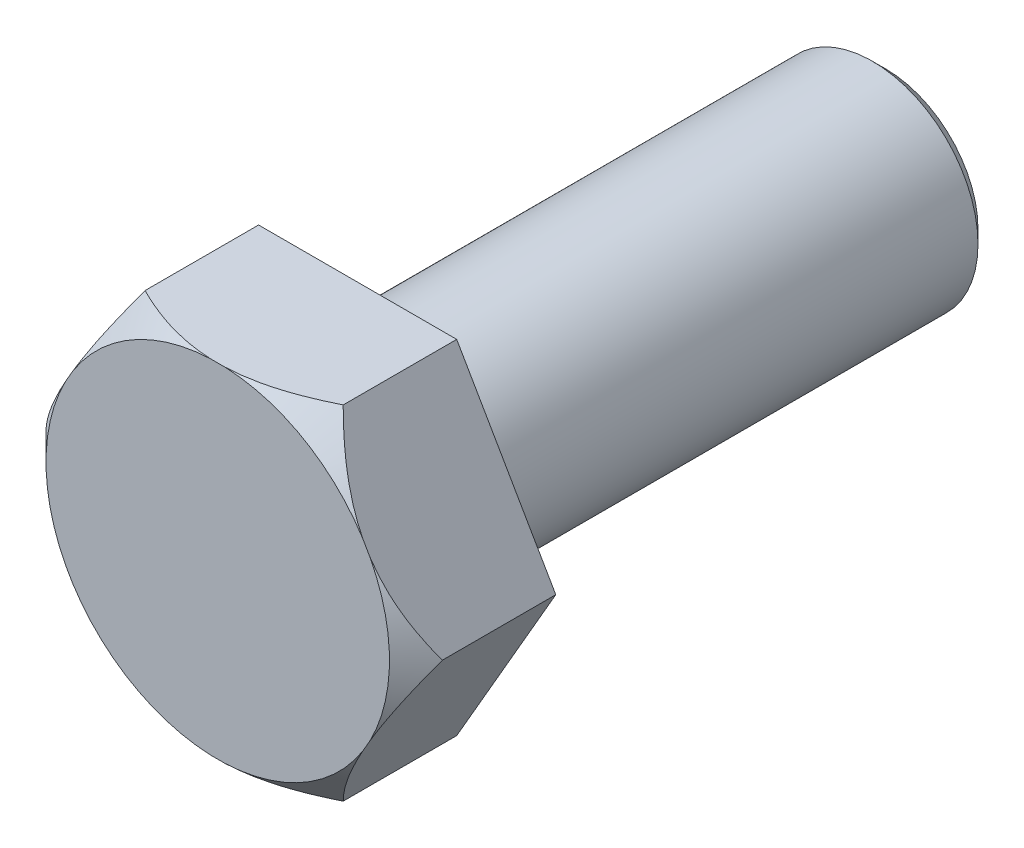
ISO-10303-21;
HEADER;
FILE_DESCRIPTION(('STEP AP214'),'2;1');
FILE_NAME('part.step','',(''),(''),'','','');
FILE_SCHEMA(('AUTOMOTIVE_DESIGN { 1 0 10303 214 1 1 1 1 }'));
ENDSEC;
DATA;
#1=APPLICATION_CONTEXT('core data for automotive mechanical design processes');
#2=APPLICATION_PROTOCOL_DEFINITION('international standard','automotive_design',2000,#1);
#3=PRODUCT_CONTEXT('',#1,'mechanical');
#4=PRODUCT('Part','Part','',(#3));
#5=PRODUCT_RELATED_PRODUCT_CATEGORY('part','',(#4));
#6=PRODUCT_DEFINITION_FORMATION('','',#4);
#7=PRODUCT_DEFINITION_CONTEXT('part definition',#1,'design');
#8=PRODUCT_DEFINITION('design','',#6,#7);
#9=PRODUCT_DEFINITION_SHAPE('','',#8);
#10=(LENGTH_UNIT() NAMED_UNIT(*) SI_UNIT(.MILLI.,.METRE.));
#11=(NAMED_UNIT(*) PLANE_ANGLE_UNIT() SI_UNIT($,.RADIAN.));
#12=(NAMED_UNIT(*) SI_UNIT($,.STERADIAN.) SOLID_ANGLE_UNIT());
#13=UNCERTAINTY_MEASURE_WITH_UNIT(LENGTH_MEASURE(1.E-05),#10,'distance_accuracy_value','');
#14=(GEOMETRIC_REPRESENTATION_CONTEXT(3) GLOBAL_UNCERTAINTY_ASSIGNED_CONTEXT((#13)) GLOBAL_UNIT_ASSIGNED_CONTEXT((#10,
#11,#12)) REPRESENTATION_CONTEXT('',''));
#15=CARTESIAN_POINT('',(0.,0.,0.));
#16=DIRECTION('',(0.,0.,1.));
#17=DIRECTION('',(1.,0.,0.));
#18=AXIS2_PLACEMENT_3D('',#15,#16,#17);
#19=CARTESIAN_POINT('',(0.,-4.,0.));
#20=DIRECTION('',(0.,0.,1.));
#21=DIRECTION('',(1.,0.,0.));
#22=AXIS2_PLACEMENT_3D('',#19,#20,#21);
#23=PLANE('',#22);
#24=CARTESIAN_POINT('',(0.,0.,0.));
#25=DIRECTION('',(0.,0.,1.));
#26=DIRECTION('',(1.,0.,0.));
#27=AXIS2_PLACEMENT_3D('',#24,#25,#26);
#28=CIRCLE('',#27,4.);
#29=CARTESIAN_POINT('',(4.,0.,0.));
#30=VERTEX_POINT('',#29);
#31=EDGE_CURVE('E11',#30,#30,#28,.T.);
#32=ORIENTED_EDGE('',*,*,#31,.T.);
#33=EDGE_LOOP('',(#32));
#34=FACE_BOUND('',#33,.T.);
#35=ADVANCED_FACE('F38',(#34),#23,.T.);
#36=CARTESIAN_POINT('',(0.,0.,0.));
#37=DIRECTION('',(0.,0.,1.));
#38=DIRECTION('',(1.,0.,0.));
#39=AXIS2_PLACEMENT_3D('',#36,#37,#38);
#40=CYLINDRICAL_SURFACE('',#39,4.);
#41=CARTESIAN_POINT('',(0.,0.,-19.5));
#42=DIRECTION('',(0.,0.,1.));
#43=DIRECTION('',(1.,0.,0.));
#44=AXIS2_PLACEMENT_3D('',#41,#42,#43);
#45=CIRCLE('',#44,4.);
#46=CARTESIAN_POINT('',(4.,0.,-19.5));
#47=VERTEX_POINT('',#46);
#48=EDGE_CURVE('E44',#47,#47,#45,.T.);
#49=ORIENTED_EDGE('',*,*,#48,.T.);
#50=EDGE_LOOP('',(#49));
#51=FACE_BOUND('',#50,.T.);
#52=ORIENTED_EDGE('',*,*,#31,.F.);
#53=EDGE_LOOP('',(#52));
#54=FACE_BOUND('',#53,.T.);
#55=ADVANCED_FACE('F64',(#51,#54),#40,.T.);
#56=CARTESIAN_POINT('',(0.,0.,-19.5));
#57=DIRECTION('',(0.,0.,1.));
#58=DIRECTION('',(1.,0.,0.));
#59=AXIS2_PLACEMENT_3D('',#56,#57,#58);
#60=CONICAL_SURFACE('',#59,4.,0.785398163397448);
#61=CARTESIAN_POINT('',(0.,0.,-20.));
#62=DIRECTION('',(0.,0.,1.));
#63=DIRECTION('',(1.,0.,0.));
#64=AXIS2_PLACEMENT_3D('',#61,#62,#63);
#65=CIRCLE('',#64,3.5);
#66=CARTESIAN_POINT('',(3.5,0.,-20.));
#67=VERTEX_POINT('',#66);
#68=EDGE_CURVE('E48',#67,#67,#65,.T.);
#69=ORIENTED_EDGE('',*,*,#68,.T.);
#70=EDGE_LOOP('',(#69));
#71=FACE_BOUND('',#70,.T.);
#72=ORIENTED_EDGE('',*,*,#48,.F.);
#73=EDGE_LOOP('',(#72));
#74=FACE_BOUND('',#73,.T.);
#75=ADVANCED_FACE('F55',(#71,#74),#60,.T.);
#76=CARTESIAN_POINT('',(0.,-3.5,-20.));
#77=DIRECTION('',(0.,0.,-1.));
#78=DIRECTION('',(-1.,0.,0.));
#79=AXIS2_PLACEMENT_3D('',#76,#77,#78);
#80=PLANE('',#79);
#81=ORIENTED_EDGE('',*,*,#68,.F.);
#82=EDGE_LOOP('',(#81));
#83=FACE_BOUND('',#82,.T.);
#84=ADVANCED_FACE('F58',(#83),#80,.T.);
#85=CLOSED_SHELL('',(#35,#55,#75,#84));
#86=MANIFOLD_SOLID_BREP('B2',#85);
#87=CARTESIAN_POINT('',(3.75277674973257,-6.5,5.3));
#88=DIRECTION('',(-0.866025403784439,0.5,0.));
#89=DIRECTION('',(-0.5,-0.866025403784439,0.));
#90=AXIS2_PLACEMENT_3D('',#87,#88,#89);
#91=PLANE('',#90);
#92=DIRECTION('',(0.,0.,-1.));
#93=VECTOR('',#92,1.);
#94=CARTESIAN_POINT('',(7.50555349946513,0.,5.3));
#95=LINE('',#94,#93);
#96=CARTESIAN_POINT('',(7.50555349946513,0.,4.3));
#97=VERTEX_POINT('',#96);
#98=CARTESIAN_POINT('',(7.50555349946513,0.,0.));
#99=VERTEX_POINT('',#98);
#100=EDGE_CURVE('E240',#97,#99,#95,.T.);
#101=ORIENTED_EDGE('',*,*,#100,.F.);
#102=CARTESIAN_POINT('',(10.1286443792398,4.54332667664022,0.704596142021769));
#103=CARTESIAN_POINT('',(10.039761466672,4.38937695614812,0.848684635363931));
#104=CARTESIAN_POINT('',(9.95052655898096,4.23481756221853,0.991912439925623));
#105=CARTESIAN_POINT('',(9.77123095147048,3.92426846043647,1.27631743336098));
#106=CARTESIAN_POINT('',(9.68117017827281,3.76827862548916,1.41749443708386));
#107=CARTESIAN_POINT('',(9.49990390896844,3.45431623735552,1.69777201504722));
#108=CARTESIAN_POINT('',(9.40869621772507,3.29633988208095,1.83686692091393));
#109=CARTESIAN_POINT('',(9.2252068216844,2.97852692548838,2.11218789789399));
#110=CARTESIAN_POINT('',(9.13292514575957,2.81869037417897,2.24841404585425));
#111=CARTESIAN_POINT('',(8.94456358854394,2.49243858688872,2.52115169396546));
#112=CARTESIAN_POINT('',(8.84844908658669,2.32596338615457,2.65756778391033));
#113=CARTESIAN_POINT('',(8.65470525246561,1.99038922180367,2.92602381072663));
#114=CARTESIAN_POINT('',(8.5570759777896,1.82129035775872,3.0580639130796));
#115=CARTESIAN_POINT('',(8.36013893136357,1.48018538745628,3.31668899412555));
#116=CARTESIAN_POINT('',(8.26083264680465,1.30818185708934,3.44327848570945));
#117=CARTESIAN_POINT('',(8.0601982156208,0.960672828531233,3.68985078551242));
#118=CARTESIAN_POINT('',(7.95887032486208,0.78516777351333,3.80983442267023));
#119=CARTESIAN_POINT('',(7.75111491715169,0.425324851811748,4.04472132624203));
#120=CARTESIAN_POINT('',(7.64462356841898,0.24087642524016,4.15940026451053));
#121=CARTESIAN_POINT('',(7.42883796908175,-0.132875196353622,4.37785828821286));
#122=CARTESIAN_POINT('',(7.31954332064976,-0.3221790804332,4.48163581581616));
#123=CARTESIAN_POINT('',(7.09850568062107,-0.705027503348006,4.67487713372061));
#124=CARTESIAN_POINT('',(6.98677906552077,-0.898543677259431,4.7644150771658));
#125=CARTESIAN_POINT('',(6.76025349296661,-1.29089747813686,4.92639894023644));
#126=CARTESIAN_POINT('',(6.64545547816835,-1.48973347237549,4.99885003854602));
#127=CARTESIAN_POINT('',(6.43587432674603,-1.85273867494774,5.11072478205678));
#128=CARTESIAN_POINT('',(6.34158660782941,-2.01604979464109,5.15384004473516));
#129=CARTESIAN_POINT('',(6.15157362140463,-2.34516194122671,5.22476075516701));
#130=CARTESIAN_POINT('',(6.0558485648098,-2.51096260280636,5.25256842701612));
#131=CARTESIAN_POINT('',(5.8637126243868,-2.84375181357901,5.29144611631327));
#132=CARTESIAN_POINT('',(5.76730326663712,-3.01073771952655,5.30254587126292));
#133=CARTESIAN_POINT('',(5.5743709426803,-3.34490630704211,5.30749252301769));
#134=CARTESIAN_POINT('',(5.47784797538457,-3.51208899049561,5.30133925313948));
#135=CARTESIAN_POINT('',(5.28569658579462,-3.84490496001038,5.27215863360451));
#136=CARTESIAN_POINT('',(5.19006652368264,-4.01054108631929,5.24917378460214));
#137=CARTESIAN_POINT('',(5.00008490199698,-4.33959890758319,5.18756324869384));
#138=CARTESIAN_POINT('',(4.90573344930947,-4.50302041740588,5.14893626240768));
#139=CARTESIAN_POINT('',(4.71846263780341,-4.82738297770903,5.05763503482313));
#140=CARTESIAN_POINT('',(4.6255484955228,-4.98831499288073,5.00491850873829));
#141=CARTESIAN_POINT('',(4.44167070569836,-5.30680066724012,4.88744691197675));
#142=CARTESIAN_POINT('',(4.35070696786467,-5.46435448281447,4.82269239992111));
#143=CARTESIAN_POINT('',(4.13900239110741,-5.83103756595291,4.65838995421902));
#144=CARTESIAN_POINT('',(4.01908237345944,-6.03874512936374,4.55462806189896));
#145=CARTESIAN_POINT('',(3.78262258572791,-6.4483054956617,4.33258564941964));
#146=CARTESIAN_POINT('',(3.66608473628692,-6.65015497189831,4.21429707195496));
#147=CARTESIAN_POINT('',(3.43582542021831,-7.0489758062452,3.96621331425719));
#148=CARTESIAN_POINT('',(3.3221102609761,-7.2459362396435,3.83639489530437));
#149=CARTESIAN_POINT('',(3.09735084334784,-7.63523097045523,3.56796602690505));
#150=CARTESIAN_POINT('',(2.98630610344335,-7.82756610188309,3.4293571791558));
#151=CARTESIAN_POINT('',(2.76596059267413,-8.20921572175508,3.14452754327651));
#152=CARTESIAN_POINT('',(2.65667036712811,-8.39851194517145,2.99827427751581));
#153=CARTESIAN_POINT('',(2.44001623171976,-8.77376791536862,2.70017211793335));
#154=CARTESIAN_POINT('',(2.33265239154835,-8.95972754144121,2.54832302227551));
#155=CARTESIAN_POINT('',(2.11967159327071,-9.32862110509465,2.24027391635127));
#156=CARTESIAN_POINT('',(2.01405293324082,-9.51155799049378,2.08407859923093));
#157=CARTESIAN_POINT('',(1.80420589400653,-9.87502372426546,1.76801397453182));
#158=CARTESIAN_POINT('',(1.69997748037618,-10.0555526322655,1.60814475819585));
#159=CARTESIAN_POINT('',(1.51776278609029,-10.3711577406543,1.32438976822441));
#160=CARTESIAN_POINT('',(1.43952456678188,-10.5066703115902,1.20114938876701));
#161=CARTESIAN_POINT('',(1.28399947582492,-10.7760476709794,0.953684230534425));
#162=CARTESIAN_POINT('',(1.20670993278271,-10.9099170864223,0.829466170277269));
#163=CARTESIAN_POINT('',(1.12968586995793,-11.0433266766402,0.704596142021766));
#164=B_SPLINE_CURVE_WITH_KNOTS('',3,(#102,#103,#104,#105,#106,#107,#108,#109,#110,#111,#112,
#113,#114,#115,#116,#117,#118,#119,#120,#121,#122,#123,#124,#125,#126,#127,#128,#129,#130,#131,
#132,#133,#134,#135,#136,#137,#138,#139,#140,#141,#142,#143,#144,#145,#146,#147,#148,#149,#150,
#151,#152,#153,#154,#155,#156,#157,#158,#159,#160,#161,#162,#163),.UNSPECIFIED.,.F.,.F.,(4,2,2,
2,2,2,2,2,2,2,2,2,2,2,2,2,2,2,2,2,2,2,2,2,2,2,2,2,2,2,4),(0.,0.686488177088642,1.3730379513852,
2.06120340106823,2.749350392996,3.4564439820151,4.16351080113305,4.8699804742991,
5.57636129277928,6.30179544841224,7.02733312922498,7.74895922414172,8.47036632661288,
9.05013970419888,9.62982882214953,10.2084849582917,10.7871466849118,11.3643522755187,
11.941605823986,12.52061163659,13.0995905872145,13.8829026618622,14.6666511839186,
15.4520168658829,16.2372398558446,17.0261239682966,17.8150365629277,18.6031280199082,
19.3911999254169,19.9887336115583,20.5836377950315),.UNSPECIFIED.);
#165=CARTESIAN_POINT('',(5.76353991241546,-3.01725604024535,5.3));
#166=VERTEX_POINT('',#165);
#167=EDGE_CURVE('E218',#97,#166,#164,.T.);
#168=ORIENTED_EDGE('',*,*,#167,.T.);
#169=DIRECTION('',(0.5,0.866025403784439,0.));
#170=VECTOR('',#169,1.);
#171=CARTESIAN_POINT('',(3.75277674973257,-6.5,5.3));
#172=LINE('',#171,#170);
#173=CARTESIAN_POINT('',(5.49479033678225,-3.48274395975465,5.3));
#174=VERTEX_POINT('',#173);
#175=EDGE_CURVE('E232',#174,#166,#172,.T.);
#176=ORIENTED_EDGE('',*,*,#175,.F.);
#177=CARTESIAN_POINT('',(3.75277674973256,-6.5,4.3));
#178=VERTEX_POINT('',#177);
#179=EDGE_CURVE('E305',#174,#178,#164,.T.);
#180=ORIENTED_EDGE('',*,*,#179,.T.);
#181=DIRECTION('',(0.,0.,-1.));
#182=VECTOR('',#181,1.);
#183=CARTESIAN_POINT('',(3.75277674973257,-6.5,5.3));
#184=LINE('',#183,#182);
#185=CARTESIAN_POINT('',(3.75277674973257,-6.5,0.));
#186=VERTEX_POINT('',#185);
#187=EDGE_CURVE('E213',#178,#186,#184,.T.);
#188=ORIENTED_EDGE('',*,*,#187,.T.);
#189=DIRECTION('',(0.5,0.866025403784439,0.));
#190=VECTOR('',#189,1.);
#191=CARTESIAN_POINT('',(3.75277674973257,-6.5,0.));
#192=LINE('',#191,#190);
#193=EDGE_CURVE('E214',#186,#99,#192,.T.);
#194=ORIENTED_EDGE('',*,*,#193,.T.);
#195=EDGE_LOOP('',(#101,#168,#176,#180,#188,#194));
#196=FACE_BOUND('',#195,.T.);
#197=ADVANCED_FACE('F93',(#196),#91,.F.);
#198=CARTESIAN_POINT('',(7.50555349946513,0.,5.3));
#199=DIRECTION('',(-0.866025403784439,-0.5,0.));
#200=DIRECTION('',(0.5,-0.866025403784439,0.));
#201=AXIS2_PLACEMENT_3D('',#198,#199,#200);
#202=PLANE('',#201);
#203=DIRECTION('',(0.,0.,-1.));
#204=VECTOR('',#203,1.);
#205=CARTESIAN_POINT('',(3.75277674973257,6.5,5.3));
#206=LINE('',#205,#204);
#207=CARTESIAN_POINT('',(3.75277674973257,6.5,4.3));
#208=VERTEX_POINT('',#207);
#209=CARTESIAN_POINT('',(3.75277674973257,6.5,0.));
#210=VERTEX_POINT('',#209);
#211=EDGE_CURVE('E239',#208,#210,#206,.T.);
#212=ORIENTED_EDGE('',*,*,#211,.F.);
#213=CARTESIAN_POINT('',(1.12968586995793,11.0433266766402,0.704596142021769));
#214=CARTESIAN_POINT('',(1.21856878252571,10.8893769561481,0.848684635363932));
#215=CARTESIAN_POINT('',(1.30780369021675,10.7348175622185,0.991912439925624));
#216=CARTESIAN_POINT('',(1.48709929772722,10.4242684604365,1.27631743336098));
#217=CARTESIAN_POINT('',(1.57716007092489,10.2682786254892,1.41749443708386));
#218=CARTESIAN_POINT('',(1.75842634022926,9.95431623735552,1.69777201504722));
#219=CARTESIAN_POINT('',(1.84963403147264,9.79633988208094,1.83686692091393));
#220=CARTESIAN_POINT('',(2.0331234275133,9.47852692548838,2.11218789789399));
#221=CARTESIAN_POINT('',(2.12540510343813,9.31869037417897,2.24841404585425));
#222=CARTESIAN_POINT('',(2.31376666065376,8.99243858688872,2.52115169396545));
#223=CARTESIAN_POINT('',(2.40988116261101,8.82596338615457,2.65756778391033));
#224=CARTESIAN_POINT('',(2.60362499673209,8.49038922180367,2.92602381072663));
#225=CARTESIAN_POINT('',(2.7012542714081,8.32129035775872,3.05806391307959));
#226=CARTESIAN_POINT('',(2.89819131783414,7.98018538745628,3.31668899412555));
#227=CARTESIAN_POINT('',(2.99749760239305,7.80818185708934,3.44327848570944));
#228=CARTESIAN_POINT('',(3.1981320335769,7.46067282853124,3.68985078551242));
#229=CARTESIAN_POINT('',(3.29945992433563,7.28516777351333,3.80983442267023));
#230=CARTESIAN_POINT('',(3.50721533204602,6.92532485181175,4.04472132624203));
#231=CARTESIAN_POINT('',(3.61370668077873,6.74087642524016,4.15940026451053));
#232=CARTESIAN_POINT('',(3.82949228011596,6.36712480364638,4.37785828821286));
#233=CARTESIAN_POINT('',(3.93878692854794,6.1778209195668,4.48163581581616));
#234=CARTESIAN_POINT('',(4.15982456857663,5.794972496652,4.67487713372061));
#235=CARTESIAN_POINT('',(4.27155118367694,5.60145632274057,4.7644150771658));
#236=CARTESIAN_POINT('',(4.49807675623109,5.20910252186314,4.92639894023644));
#237=CARTESIAN_POINT('',(4.61287477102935,5.01026652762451,4.99885003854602));
#238=CARTESIAN_POINT('',(4.82245592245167,4.64726132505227,5.11072478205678));
#239=CARTESIAN_POINT('',(4.91674364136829,4.48395020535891,5.15384004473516));
#240=CARTESIAN_POINT('',(5.10675662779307,4.15483805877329,5.22476075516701));
#241=CARTESIAN_POINT('',(5.20248168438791,3.98903739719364,5.25256842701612));
#242=CARTESIAN_POINT('',(5.3946176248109,3.65624818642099,5.29144611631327));
#243=CARTESIAN_POINT('',(5.49102698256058,3.48926228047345,5.30254587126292));
#244=CARTESIAN_POINT('',(5.6839593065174,3.15509369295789,5.30749252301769));
#245=CARTESIAN_POINT('',(5.78048227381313,2.98791100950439,5.30133925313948));
#246=CARTESIAN_POINT('',(5.97263366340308,2.65509503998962,5.27215863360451));
#247=CARTESIAN_POINT('',(6.06826372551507,2.48945891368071,5.24917378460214));
#248=CARTESIAN_POINT('',(6.25824534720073,2.16040109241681,5.18756324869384));
#249=CARTESIAN_POINT('',(6.35259679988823,1.99697958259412,5.14893626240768));
#250=CARTESIAN_POINT('',(6.5398676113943,1.67261702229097,5.05763503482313));
#251=CARTESIAN_POINT('',(6.6327817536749,1.51168500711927,5.00491850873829));
#252=CARTESIAN_POINT('',(6.81665954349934,1.19319933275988,4.88744691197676));
#253=CARTESIAN_POINT('',(6.90762328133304,1.03564551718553,4.82269239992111));
#254=CARTESIAN_POINT('',(7.1193278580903,0.668962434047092,4.65838995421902));
#255=CARTESIAN_POINT('',(7.23924787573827,0.461254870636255,4.55462806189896));
#256=CARTESIAN_POINT('',(7.4757076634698,0.0516945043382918,4.33258564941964));
#257=CARTESIAN_POINT('',(7.59224551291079,-0.150154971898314,4.21429707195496));
#258=CARTESIAN_POINT('',(7.82250482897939,-0.548975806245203,3.96621331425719));
#259=CARTESIAN_POINT('',(7.93621998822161,-0.7459362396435,3.83639489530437));
#260=CARTESIAN_POINT('',(8.16097940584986,-1.13523097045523,3.56796602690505));
#261=CARTESIAN_POINT('',(8.27202414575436,-1.32756610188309,3.4293571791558));
#262=CARTESIAN_POINT('',(8.49236965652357,-1.70921572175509,3.14452754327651));
#263=CARTESIAN_POINT('',(8.6016598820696,-1.89851194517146,2.99827427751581));
#264=CARTESIAN_POINT('',(8.81831401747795,-2.27376791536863,2.70017211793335));
#265=CARTESIAN_POINT('',(8.92567785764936,-2.45972754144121,2.5483230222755));
#266=CARTESIAN_POINT('',(9.138658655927,-2.82862110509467,2.24027391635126));
#267=CARTESIAN_POINT('',(9.24427731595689,-3.01155799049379,2.08407859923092));
#268=CARTESIAN_POINT('',(9.45412435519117,-3.37502372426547,1.76801397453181));
#269=CARTESIAN_POINT('',(9.55835276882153,-3.55555263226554,1.60814475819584));
#270=CARTESIAN_POINT('',(9.74056746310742,-3.87115774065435,1.3243897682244));
#271=CARTESIAN_POINT('',(9.81880568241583,-4.00667031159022,1.20114938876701));
#272=CARTESIAN_POINT('',(9.97433077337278,-4.27604767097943,0.953684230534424));
#273=CARTESIAN_POINT('',(10.051620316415,-4.40991708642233,0.829466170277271));
#274=CARTESIAN_POINT('',(10.1286443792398,-4.54332667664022,0.704596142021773));
#275=B_SPLINE_CURVE_WITH_KNOTS('',3,(#213,#214,#215,#216,#217,#218,#219,#220,#221,#222,#223,
#224,#225,#226,#227,#228,#229,#230,#231,#232,#233,#234,#235,#236,#237,#238,#239,#240,#241,#242,
#243,#244,#245,#246,#247,#248,#249,#250,#251,#252,#253,#254,#255,#256,#257,#258,#259,#260,#261,
#262,#263,#264,#265,#266,#267,#268,#269,#270,#271,#272,#273,#274),.UNSPECIFIED.,.F.,.F.,(4,2,2,
2,2,2,2,2,2,2,2,2,2,2,2,2,2,2,2,2,2,2,2,2,2,2,2,2,2,2,4),(0.,0.686488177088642,1.37303795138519,
2.06120340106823,2.749350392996,3.4564439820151,4.16351080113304,4.86998047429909,
5.57636129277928,6.30179544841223,7.02733312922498,7.74895922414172,8.47036632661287,
9.05013970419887,9.62982882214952,10.2084849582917,10.7871466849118,11.3643522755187,
11.941605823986,12.52061163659,13.0995905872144,13.8829026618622,14.6666511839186,
15.4520168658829,16.2372398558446,17.0261239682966,17.8150365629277,18.6031280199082,
19.391199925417,19.9887336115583,20.5836377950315),.UNSPECIFIED.);
#276=CARTESIAN_POINT('',(5.49479033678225,3.48274395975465,5.3));
#277=VERTEX_POINT('',#276);
#278=EDGE_CURVE('E268',#208,#277,#275,.T.);
#279=ORIENTED_EDGE('',*,*,#278,.T.);
#280=DIRECTION('',(-0.5,0.866025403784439,0.));
#281=VECTOR('',#280,1.);
#282=CARTESIAN_POINT('',(7.50555349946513,0.,5.3));
#283=LINE('',#282,#281);
#284=CARTESIAN_POINT('',(5.76353991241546,3.01725604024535,5.3));
#285=VERTEX_POINT('',#284);
#286=EDGE_CURVE('E207',#285,#277,#283,.T.);
#287=ORIENTED_EDGE('',*,*,#286,.F.);
#288=EDGE_CURVE('E273',#285,#97,#275,.T.);
#289=ORIENTED_EDGE('',*,*,#288,.T.);
#290=ORIENTED_EDGE('',*,*,#100,.T.);
#291=DIRECTION('',(-0.5,0.866025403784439,0.));
#292=VECTOR('',#291,1.);
#293=CARTESIAN_POINT('',(7.50555349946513,0.,0.));
#294=LINE('',#293,#292);
#295=EDGE_CURVE('E217',#99,#210,#294,.T.);
#296=ORIENTED_EDGE('',*,*,#295,.T.);
#297=EDGE_LOOP('',(#212,#279,#287,#289,#290,#296));
#298=FACE_BOUND('',#297,.T.);
#299=ADVANCED_FACE('F278',(#298),#202,.F.);
#300=CARTESIAN_POINT('',(3.75277674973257,6.5,5.3));
#301=DIRECTION('',(0.,-1.,0.));
#302=DIRECTION('',(1.,0.,0.));
#303=AXIS2_PLACEMENT_3D('',#300,#301,#302);
#304=PLANE('',#303);
#305=DIRECTION('',(0.,0.,-1.));
#306=VECTOR('',#305,1.);
#307=CARTESIAN_POINT('',(-3.75277674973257,6.5,5.3));
#308=LINE('',#307,#306);
#309=CARTESIAN_POINT('',(-3.75277674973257,6.5,4.3));
#310=VERTEX_POINT('',#309);
#311=CARTESIAN_POINT('',(-3.75277674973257,6.5,0.));
#312=VERTEX_POINT('',#311);
#313=EDGE_CURVE('E237',#310,#312,#308,.T.);
#314=ORIENTED_EDGE('',*,*,#313,.F.);
#315=CARTESIAN_POINT('',(-8.29610342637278,6.5,1.26632525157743));
#316=CARTESIAN_POINT('',(-8.11036530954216,6.5,1.41250581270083));
#317=CARTESIAN_POINT('',(-7.92373684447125,6.5,1.55756954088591));
#318=CARTESIAN_POINT('',(-7.54835509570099,6.5,1.84498409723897));
#319=CARTESIAN_POINT('',(-7.35960146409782,6.5,1.98733447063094));
#320=CARTESIAN_POINT('',(-6.97873252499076,6.5,2.2695011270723));
#321=CARTESIAN_POINT('',(-6.7866050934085,6.5,2.40930108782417));
#322=CARTESIAN_POINT('',(-6.39953728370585,6.5,2.68493925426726));
#323=CARTESIAN_POINT('',(-6.20459704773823,6.5,2.82077765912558));
#324=CARTESIAN_POINT('',(-5.80175036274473,6.5,3.09421885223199));
#325=CARTESIAN_POINT('',(-5.59367836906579,6.5,3.231578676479));
#326=CARTESIAN_POINT('',(-5.17329124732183,6.5,3.49972871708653));
#327=CARTESIAN_POINT('',(-4.96097565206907,6.5,3.63051820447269));
#328=CARTESIAN_POINT('',(-4.53185755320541,6.5,3.88357409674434));
#329=CARTESIAN_POINT('',(-4.31506466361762,6.5,4.00585671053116));
#330=CARTESIAN_POINT('',(-3.87593140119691,6.5,4.23995118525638));
#331=CARTESIAN_POINT('',(-3.65359273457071,6.5,4.35176621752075));
#332=CARTESIAN_POINT('',(-3.22593082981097,6.5,4.55126761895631));
#333=CARTESIAN_POINT('',(-3.02121813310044,6.5,4.64025315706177));
#334=CARTESIAN_POINT('',(-2.60646306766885,6.5,4.80502186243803));
#335=CARTESIAN_POINT('',(-2.39642019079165,6.5,4.88080376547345));
#336=CARTESIAN_POINT('',(-1.97356357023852,6.5,5.01546630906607));
#337=CARTESIAN_POINT('',(-1.76080909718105,6.5,5.07453054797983));
#338=CARTESIAN_POINT('',(-1.33093571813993,6.5,5.17398366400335));
#339=CARTESIAN_POINT('',(-1.11381737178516,6.5,5.21437492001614));
#340=CARTESIAN_POINT('',(-0.672554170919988,6.5,5.27457108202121));
#341=CARTESIAN_POINT('',(-0.448353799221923,6.5,5.29397782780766));
#342=CARTESIAN_POINT('',(0.000845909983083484,6.5,5.30942901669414));
#343=CARTESIAN_POINT('',(0.225845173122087,6.5,5.30547558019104));
#344=CARTESIAN_POINT('',(0.67488777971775,6.5,5.27446419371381));
#345=CARTESIAN_POINT('',(0.898926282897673,6.5,5.24733749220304));
#346=CARTESIAN_POINT('',(1.34336613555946,6.5,5.17180698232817));
#347=CARTESIAN_POINT('',(1.56376649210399,6.5,5.12339746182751));
#348=CARTESIAN_POINT('',(2.06628953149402,6.5,4.99055568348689));
#349=CARTESIAN_POINT('',(2.34668289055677,6.5,4.89963518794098));
#350=CARTESIAN_POINT('',(2.89824997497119,6.5,4.69329359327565));
#351=CARTESIAN_POINT('',(3.16941809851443,6.5,4.57785790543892));
#352=CARTESIAN_POINT('',(3.70495151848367,6.5,4.32757146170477));
#353=CARTESIAN_POINT('',(3.96925216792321,6.5,4.19258424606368));
#354=CARTESIAN_POINT('',(4.49001736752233,6.5,3.90855044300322));
#355=CARTESIAN_POINT('',(4.74648371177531,6.5,3.75950710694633));
#356=CARTESIAN_POINT('',(5.2907154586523,6.5,3.42770091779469));
#357=CARTESIAN_POINT('',(5.57743102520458,6.5,3.24322742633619));
#358=CARTESIAN_POINT('',(6.14392762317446,6.5,2.86387292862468));
#359=CARTESIAN_POINT('',(6.42370706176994,6.5,2.66898956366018));
#360=CARTESIAN_POINT('',(6.97140928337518,6.5,2.27586119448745));
#361=CARTESIAN_POINT('',(7.23945723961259,6.5,2.07778986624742));
#362=CARTESIAN_POINT('',(7.63813759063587,6.5,1.77641508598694));
#363=CARTESIAN_POINT('',(7.77042024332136,6.5,1.67528153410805));
#364=CARTESIAN_POINT('',(8.0339850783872,6.5,1.47172940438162));
#365=CARTESIAN_POINT('',(8.16526730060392,6.5,1.36931087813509));
#366=CARTESIAN_POINT('',(8.29610342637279,6.5,1.26632525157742));
#367=B_SPLINE_CURVE_WITH_KNOTS('',3,(#315,#316,#317,#318,#319,#320,#321,#322,#323,#324,#325,
#326,#327,#328,#329,#330,#331,#332,#333,#334,#335,#336,#337,#338,#339,#340,#341,#342,#343,#344,
#345,#346,#347,#348,#349,#350,#351,#352,#353,#354,#355,#356,#357,#358,#359,#360,#361,#362,#363,
#364,#365,#366),.UNSPECIFIED.,.F.,.F.,(4,2,2,2,2,2,2,2,2,2,2,2,2,2,2,2,2,2,2,2,2,2,2,2,2,4),(0.,
0.709097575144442,1.41831297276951,2.13109111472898,2.84383335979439,3.59170118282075,
4.3396517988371,5.0861358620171,5.83239302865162,6.5016733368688,7.17101769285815,
7.83269743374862,8.49429285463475,9.16823229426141,9.84211056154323,10.5179950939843,
11.1940611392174,12.0768086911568,12.9600830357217,13.8498492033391,14.7394100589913,
15.7619006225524,16.7846238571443,17.7843881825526,18.2839221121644,18.7834360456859),.UNSPECIFIED.);
#368=CARTESIAN_POINT('',(-0.26874957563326,6.5,5.3));
#369=VERTEX_POINT('',#368);
#370=EDGE_CURVE('E255',#310,#369,#367,.T.);
#371=ORIENTED_EDGE('',*,*,#370,.T.);
#372=DIRECTION('',(-1.,0.,0.));
#373=VECTOR('',#372,1.);
#374=CARTESIAN_POINT('',(3.75277674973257,6.5,5.3));
#375=LINE('',#374,#373);
#376=CARTESIAN_POINT('',(0.268749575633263,6.5,5.3));
#377=VERTEX_POINT('',#376);
#378=EDGE_CURVE('E203',#377,#369,#375,.T.);
#379=ORIENTED_EDGE('',*,*,#378,.F.);
#380=EDGE_CURVE('E261',#377,#208,#367,.T.);
#381=ORIENTED_EDGE('',*,*,#380,.T.);
#382=ORIENTED_EDGE('',*,*,#211,.T.);
#383=DIRECTION('',(-1.,0.,0.));
#384=VECTOR('',#383,1.);
#385=CARTESIAN_POINT('',(3.75277674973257,6.5,0.));
#386=LINE('',#385,#384);
#387=EDGE_CURVE('E221',#210,#312,#386,.T.);
#388=ORIENTED_EDGE('',*,*,#387,.T.);
#389=EDGE_LOOP('',(#314,#371,#379,#381,#382,#388));
#390=FACE_BOUND('',#389,.T.);
#391=ADVANCED_FACE('F259',(#390),#304,.F.);
#392=CARTESIAN_POINT('',(-3.75277674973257,6.5,5.3));
#393=DIRECTION('',(0.866025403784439,-0.5,0.));
#394=DIRECTION('',(0.5,0.866025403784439,0.));
#395=AXIS2_PLACEMENT_3D('',#392,#393,#394);
#396=PLANE('',#395);
#397=DIRECTION('',(0.,0.,-1.));
#398=VECTOR('',#397,1.);
#399=CARTESIAN_POINT('',(-7.50555349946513,0.,5.3));
#400=LINE('',#399,#398);
#401=CARTESIAN_POINT('',(-7.50555349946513,0.,4.3));
#402=VERTEX_POINT('',#401);
#403=CARTESIAN_POINT('',(-7.50555349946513,0.,0.));
#404=VERTEX_POINT('',#403);
#405=EDGE_CURVE('E195',#402,#404,#400,.T.);
#406=ORIENTED_EDGE('',*,*,#405,.F.);
#407=CARTESIAN_POINT('',(-10.1286443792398,-4.54332667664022,0.704596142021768));
#408=CARTESIAN_POINT('',(-10.039761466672,-4.38937695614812,0.84868463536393));
#409=CARTESIAN_POINT('',(-9.95052655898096,-4.23481756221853,0.991912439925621));
#410=CARTESIAN_POINT('',(-9.77123095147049,-3.92426846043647,1.27631743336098));
#411=CARTESIAN_POINT('',(-9.68117017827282,-3.76827862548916,1.41749443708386));
#412=CARTESIAN_POINT('',(-9.49990390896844,-3.45431623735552,1.69777201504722));
#413=CARTESIAN_POINT('',(-9.40869621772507,-3.29633988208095,1.83686692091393));
#414=CARTESIAN_POINT('',(-9.2252068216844,-2.97852692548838,2.11218789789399));
#415=CARTESIAN_POINT('',(-9.13292514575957,-2.81869037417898,2.24841404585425));
#416=CARTESIAN_POINT('',(-8.94456358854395,-2.49243858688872,2.52115169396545));
#417=CARTESIAN_POINT('',(-8.84844908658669,-2.32596338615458,2.65756778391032));
#418=CARTESIAN_POINT('',(-8.65470525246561,-1.99038922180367,2.92602381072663));
#419=CARTESIAN_POINT('',(-8.55707597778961,-1.82129035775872,3.05806391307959));
#420=CARTESIAN_POINT('',(-8.36013893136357,-1.48018538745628,3.31668899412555));
#421=CARTESIAN_POINT('',(-8.26083264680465,-1.30818185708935,3.44327848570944));
#422=CARTESIAN_POINT('',(-8.0601982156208,-0.96067282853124,3.68985078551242));
#423=CARTESIAN_POINT('',(-7.95887032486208,-0.785167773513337,3.80983442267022));
#424=CARTESIAN_POINT('',(-7.75111491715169,-0.425324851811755,4.04472132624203));
#425=CARTESIAN_POINT('',(-7.64462356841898,-0.240876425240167,4.15940026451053));
#426=CARTESIAN_POINT('',(-7.42883796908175,0.132875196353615,4.37785828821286));
#427=CARTESIAN_POINT('',(-7.31954332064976,0.322179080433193,4.48163581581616));
#428=CARTESIAN_POINT('',(-7.09850568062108,0.705027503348,4.67487713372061));
#429=CARTESIAN_POINT('',(-6.98677906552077,0.898543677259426,4.7644150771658));
#430=CARTESIAN_POINT('',(-6.76025349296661,1.29089747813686,4.92639894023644));
#431=CARTESIAN_POINT('',(-6.64545547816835,1.48973347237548,4.99885003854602));
#432=CARTESIAN_POINT('',(-6.43587432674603,1.85273867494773,5.11072478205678));
#433=CARTESIAN_POINT('',(-6.34158660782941,2.01604979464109,5.15384004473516));
#434=CARTESIAN_POINT('',(-6.15157362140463,2.3451619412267,5.22476075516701));
#435=CARTESIAN_POINT('',(-6.0558485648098,2.51096260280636,5.25256842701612));
#436=CARTESIAN_POINT('',(-5.86371262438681,2.84375181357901,5.29144611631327));
#437=CARTESIAN_POINT('',(-5.76730326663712,3.01073771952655,5.30254587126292));
#438=CARTESIAN_POINT('',(-5.5743709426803,3.3449063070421,5.30749252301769));
#439=CARTESIAN_POINT('',(-5.47784797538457,3.51208899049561,5.30133925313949));
#440=CARTESIAN_POINT('',(-5.28569658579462,3.84490496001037,5.27215863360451));
#441=CARTESIAN_POINT('',(-5.19006652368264,4.01054108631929,5.24917378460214));
#442=CARTESIAN_POINT('',(-5.00008490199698,4.33959890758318,5.18756324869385));
#443=CARTESIAN_POINT('',(-4.90573344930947,4.50302041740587,5.14893626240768));
#444=CARTESIAN_POINT('',(-4.71846263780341,4.82738297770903,5.05763503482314));
#445=CARTESIAN_POINT('',(-4.6255484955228,4.98831499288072,5.00491850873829));
#446=CARTESIAN_POINT('',(-4.44167070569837,5.30680066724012,4.88744691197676));
#447=CARTESIAN_POINT('',(-4.35070696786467,5.46435448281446,4.82269239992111));
#448=CARTESIAN_POINT('',(-4.13900239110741,5.8310375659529,4.65838995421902));
#449=CARTESIAN_POINT('',(-4.01908237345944,6.03874512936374,4.55462806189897));
#450=CARTESIAN_POINT('',(-3.78262258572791,6.4483054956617,4.33258564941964));
#451=CARTESIAN_POINT('',(-3.66608473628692,6.6501549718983,4.21429707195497));
#452=CARTESIAN_POINT('',(-3.43582542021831,7.04897580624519,3.9662133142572));
#453=CARTESIAN_POINT('',(-3.3221102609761,7.24593623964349,3.83639489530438));
#454=CARTESIAN_POINT('',(-3.09735084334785,7.63523097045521,3.56796602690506));
#455=CARTESIAN_POINT('',(-2.98630610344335,7.82756610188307,3.42935717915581));
#456=CARTESIAN_POINT('',(-2.76596059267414,8.20921572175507,3.14452754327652));
#457=CARTESIAN_POINT('',(-2.65667036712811,8.39851194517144,2.99827427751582));
#458=CARTESIAN_POINT('',(-2.44001623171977,8.77376791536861,2.70017211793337));
#459=CARTESIAN_POINT('',(-2.33265239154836,8.95972754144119,2.54832302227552));
#460=CARTESIAN_POINT('',(-2.11967159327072,9.32862110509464,2.24027391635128));
#461=CARTESIAN_POINT('',(-2.01405293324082,9.51155799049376,2.08407859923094));
#462=CARTESIAN_POINT('',(-1.80420589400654,9.87502372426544,1.76801397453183));
#463=CARTESIAN_POINT('',(-1.69997748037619,10.0555526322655,1.60814475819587));
#464=CARTESIAN_POINT('',(-1.51776278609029,10.3711577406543,1.32438976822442));
#465=CARTESIAN_POINT('',(-1.43952456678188,10.5066703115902,1.20114938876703));
#466=CARTESIAN_POINT('',(-1.28399947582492,10.7760476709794,0.953684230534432));
#467=CARTESIAN_POINT('',(-1.20670993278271,10.9099170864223,0.829466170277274));
#468=CARTESIAN_POINT('',(-1.12968586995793,11.0433266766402,0.704596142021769));
#469=B_SPLINE_CURVE_WITH_KNOTS('',3,(#407,#408,#409,#410,#411,#412,#413,#414,#415,#416,#417,
#418,#419,#420,#421,#422,#423,#424,#425,#426,#427,#428,#429,#430,#431,#432,#433,#434,#435,#436,
#437,#438,#439,#440,#441,#442,#443,#444,#445,#446,#447,#448,#449,#450,#451,#452,#453,#454,#455,
#456,#457,#458,#459,#460,#461,#462,#463,#464,#465,#466,#467,#468),.UNSPECIFIED.,.F.,.F.,(4,2,2,
2,2,2,2,2,2,2,2,2,2,2,2,2,2,2,2,2,2,2,2,2,2,2,2,2,2,2,4),(0.,0.686488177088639,1.37303795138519,
2.06120340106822,2.749350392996,3.45644398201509,4.16351080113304,4.86998047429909,
5.57636129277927,6.30179544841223,7.02733312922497,7.74895922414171,8.47036632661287,
9.05013970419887,9.62982882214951,10.2084849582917,10.7871466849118,11.3643522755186,
11.9416058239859,12.52061163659,13.0995905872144,13.8829026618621,14.6666511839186,
15.4520168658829,16.2372398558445,17.0261239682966,17.8150365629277,18.6031280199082,
19.3911999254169,19.9887336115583,20.5836377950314),.UNSPECIFIED.);
#470=CARTESIAN_POINT('',(-5.76353991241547,3.01725604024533,5.3));
#471=VERTEX_POINT('',#470);
#472=EDGE_CURVE('E182',#402,#471,#469,.T.);
#473=ORIENTED_EDGE('',*,*,#472,.T.);
#474=DIRECTION('',(-0.5,-0.866025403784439,0.));
#475=VECTOR('',#474,1.);
#476=CARTESIAN_POINT('',(-3.75277674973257,6.5,5.3));
#477=LINE('',#476,#475);
#478=CARTESIAN_POINT('',(-5.49479033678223,3.48274395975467,5.3));
#479=VERTEX_POINT('',#478);
#480=EDGE_CURVE('E193',#479,#471,#477,.T.);
#481=ORIENTED_EDGE('',*,*,#480,.F.);
#482=EDGE_CURVE('E196',#479,#310,#469,.T.);
#483=ORIENTED_EDGE('',*,*,#482,.T.);
#484=ORIENTED_EDGE('',*,*,#313,.T.);
#485=DIRECTION('',(-0.5,-0.866025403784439,0.));
#486=VECTOR('',#485,1.);
#487=CARTESIAN_POINT('',(-3.75277674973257,6.5,0.));
#488=LINE('',#487,#486);
#489=EDGE_CURVE('E224',#312,#404,#488,.T.);
#490=ORIENTED_EDGE('',*,*,#489,.T.);
#491=EDGE_LOOP('',(#406,#473,#481,#483,#484,#490));
#492=FACE_BOUND('',#491,.T.);
#493=ADVANCED_FACE('F191',(#492),#396,.F.);
#494=CARTESIAN_POINT('',(-7.50555349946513,0.,5.3));
#495=DIRECTION('',(0.866025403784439,0.5,0.));
#496=DIRECTION('',(-0.5,0.866025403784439,0.));
#497=AXIS2_PLACEMENT_3D('',#494,#495,#496);
#498=PLANE('',#497);
#499=DIRECTION('',(0.,0.,-1.));
#500=VECTOR('',#499,1.);
#501=CARTESIAN_POINT('',(-3.75277674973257,-6.5,5.3));
#502=LINE('',#501,#500);
#503=CARTESIAN_POINT('',(-3.75277674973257,-6.5,4.3));
#504=VERTEX_POINT('',#503);
#505=CARTESIAN_POINT('',(-3.75277674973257,-6.5,0.));
#506=VERTEX_POINT('',#505);
#507=EDGE_CURVE('E234',#504,#506,#502,.T.);
#508=ORIENTED_EDGE('',*,*,#507,.F.);
#509=CARTESIAN_POINT('',(-1.12968586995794,-11.0433266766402,0.70459614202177));
#510=CARTESIAN_POINT('',(-1.21856878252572,-10.8893769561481,0.848684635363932));
#511=CARTESIAN_POINT('',(-1.30780369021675,-10.7348175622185,0.991912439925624));
#512=CARTESIAN_POINT('',(-1.48709929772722,-10.4242684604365,1.27631743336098));
#513=CARTESIAN_POINT('',(-1.57716007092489,-10.2682786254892,1.41749443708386));
#514=CARTESIAN_POINT('',(-1.75842634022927,-9.95431623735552,1.69777201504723));
#515=CARTESIAN_POINT('',(-1.84963403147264,-9.79633988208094,1.83686692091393));
#516=CARTESIAN_POINT('',(-2.03312342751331,-9.47852692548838,2.11218789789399));
#517=CARTESIAN_POINT('',(-2.12540510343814,-9.31869037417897,2.24841404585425));
#518=CARTESIAN_POINT('',(-2.31376666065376,-8.99243858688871,2.52115169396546));
#519=CARTESIAN_POINT('',(-2.40988116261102,-8.82596338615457,2.65756778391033));
#520=CARTESIAN_POINT('',(-2.6036249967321,-8.49038922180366,2.92602381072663));
#521=CARTESIAN_POINT('',(-2.70125427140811,-8.32129035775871,3.0580639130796));
#522=CARTESIAN_POINT('',(-2.89819131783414,-7.98018538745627,3.31668899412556));
#523=CARTESIAN_POINT('',(-2.99749760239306,-7.80818185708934,3.44327848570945));
#524=CARTESIAN_POINT('',(-3.19813203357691,-7.46067282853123,3.68985078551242));
#525=CARTESIAN_POINT('',(-3.29945992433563,-7.28516777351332,3.80983442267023));
#526=CARTESIAN_POINT('',(-3.50721533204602,-6.92532485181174,4.04472132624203));
#527=CARTESIAN_POINT('',(-3.61370668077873,-6.74087642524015,4.15940026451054));
#528=CARTESIAN_POINT('',(-3.82949228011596,-6.36712480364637,4.37785828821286));
#529=CARTESIAN_POINT('',(-3.93878692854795,-6.17782091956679,4.48163581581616));
#530=CARTESIAN_POINT('',(-4.15982456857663,-5.79497249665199,4.67487713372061));
#531=CARTESIAN_POINT('',(-4.27155118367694,-5.60145632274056,4.7644150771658));
#532=CARTESIAN_POINT('',(-4.4980767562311,-5.20910252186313,4.92639894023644));
#533=CARTESIAN_POINT('',(-4.61287477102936,-5.0102665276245,4.99885003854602));
#534=CARTESIAN_POINT('',(-4.82245592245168,-4.64726132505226,5.11072478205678));
#535=CARTESIAN_POINT('',(-4.9167436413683,-4.4839502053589,5.15384004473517));
#536=CARTESIAN_POINT('',(-5.10675662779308,-4.15483805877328,5.22476075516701));
#537=CARTESIAN_POINT('',(-5.20248168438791,-3.98903739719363,5.25256842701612));
#538=CARTESIAN_POINT('',(-5.3946176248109,-3.65624818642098,5.29144611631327));
#539=CARTESIAN_POINT('',(-5.49102698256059,-3.48926228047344,5.30254587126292));
#540=CARTESIAN_POINT('',(-5.68395930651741,-3.15509369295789,5.30749252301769));
#541=CARTESIAN_POINT('',(-5.78048227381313,-2.98791100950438,5.30133925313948));
#542=CARTESIAN_POINT('',(-5.97263366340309,-2.65509503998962,5.27215863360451));
#543=CARTESIAN_POINT('',(-6.06826372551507,-2.4894589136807,5.24917378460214));
#544=CARTESIAN_POINT('',(-6.25824534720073,-2.16040109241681,5.18756324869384));
#545=CARTESIAN_POINT('',(-6.35259679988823,-1.99697958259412,5.14893626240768));
#546=CARTESIAN_POINT('',(-6.5398676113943,-1.67261702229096,5.05763503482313));
#547=CARTESIAN_POINT('',(-6.6327817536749,-1.51168500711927,5.00491850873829));
#548=CARTESIAN_POINT('',(-6.81665954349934,-1.19319933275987,4.88744691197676));
#549=CARTESIAN_POINT('',(-6.90762328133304,-1.03564551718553,4.82269239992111));
#550=CARTESIAN_POINT('',(-7.1193278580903,-0.668962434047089,4.65838995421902));
#551=CARTESIAN_POINT('',(-7.23924787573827,-0.461254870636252,4.55462806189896));
#552=CARTESIAN_POINT('',(-7.4757076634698,-0.0516945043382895,4.33258564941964));
#553=CARTESIAN_POINT('',(-7.59224551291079,0.150154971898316,4.21429707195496));
#554=CARTESIAN_POINT('',(-7.82250482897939,0.548975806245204,3.96621331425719));
#555=CARTESIAN_POINT('',(-7.9362199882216,0.745936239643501,3.83639489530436));
#556=CARTESIAN_POINT('',(-8.16097940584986,1.13523097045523,3.56796602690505));
#557=CARTESIAN_POINT('',(-8.27202414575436,1.32756610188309,3.4293571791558));
#558=CARTESIAN_POINT('',(-8.49236965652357,1.70921572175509,3.14452754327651));
#559=CARTESIAN_POINT('',(-8.6016598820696,1.89851194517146,2.99827427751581));
#560=CARTESIAN_POINT('',(-8.81831401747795,2.27376791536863,2.70017211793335));
#561=CARTESIAN_POINT('',(-8.92567785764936,2.45972754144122,2.5483230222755));
#562=CARTESIAN_POINT('',(-9.138658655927,2.82862110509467,2.24027391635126));
#563=CARTESIAN_POINT('',(-9.24427731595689,3.01155799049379,2.08407859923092));
#564=CARTESIAN_POINT('',(-9.45412435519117,3.37502372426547,1.76801397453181));
#565=CARTESIAN_POINT('',(-9.55835276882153,3.55555263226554,1.60814475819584));
#566=CARTESIAN_POINT('',(-9.74056746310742,3.87115774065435,1.3243897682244));
#567=CARTESIAN_POINT('',(-9.81880568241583,4.00667031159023,1.20114938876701));
#568=CARTESIAN_POINT('',(-9.97433077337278,4.27604767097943,0.953684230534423));
#569=CARTESIAN_POINT('',(-10.051620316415,4.40991708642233,0.82946617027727));
#570=CARTESIAN_POINT('',(-10.1286443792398,4.54332667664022,0.704596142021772));
#571=B_SPLINE_CURVE_WITH_KNOTS('',3,(#509,#510,#511,#512,#513,#514,#515,#516,#517,#518,#519,
#520,#521,#522,#523,#524,#525,#526,#527,#528,#529,#530,#531,#532,#533,#534,#535,#536,#537,#538,
#539,#540,#541,#542,#543,#544,#545,#546,#547,#548,#549,#550,#551,#552,#553,#554,#555,#556,#557,
#558,#559,#560,#561,#562,#563,#564,#565,#566,#567,#568,#569,#570),.UNSPECIFIED.,.F.,.F.,(4,2,2,
2,2,2,2,2,2,2,2,2,2,2,2,2,2,2,2,2,2,2,2,2,2,2,2,2,2,2,4),(0.,0.686488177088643,1.3730379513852,
2.06120340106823,2.74935039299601,3.4564439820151,4.16351080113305,4.8699804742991,
5.57636129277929,6.30179544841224,7.02733312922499,7.74895922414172,8.47036632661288,
9.05013970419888,9.62982882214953,10.2084849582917,10.7871466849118,11.3643522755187,
11.941605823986,12.52061163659,13.0995905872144,13.8829026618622,14.6666511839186,
15.4520168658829,16.2372398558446,17.0261239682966,17.8150365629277,18.6031280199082,
19.391199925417,19.9887336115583,20.5836377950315),.UNSPECIFIED.);
#572=CARTESIAN_POINT('',(-5.49479033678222,-3.48274395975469,5.3));
#573=VERTEX_POINT('',#572);
#574=EDGE_CURVE('E298',#504,#573,#571,.T.);
#575=ORIENTED_EDGE('',*,*,#574,.T.);
#576=DIRECTION('',(0.5,-0.866025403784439,0.));
#577=VECTOR('',#576,1.);
#578=CARTESIAN_POINT('',(-7.50555349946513,0.,5.3));
#579=LINE('',#578,#577);
#580=CARTESIAN_POINT('',(-5.76353991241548,-3.01725604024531,5.3));
#581=VERTEX_POINT('',#580);
#582=EDGE_CURVE('E202',#581,#573,#579,.T.);
#583=ORIENTED_EDGE('',*,*,#582,.F.);
#584=EDGE_CURVE('E117',#581,#402,#571,.T.);
#585=ORIENTED_EDGE('',*,*,#584,.T.);
#586=ORIENTED_EDGE('',*,*,#405,.T.);
#587=DIRECTION('',(0.5,-0.866025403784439,0.));
#588=VECTOR('',#587,1.);
#589=CARTESIAN_POINT('',(-7.50555349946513,0.,0.));
#590=LINE('',#589,#588);
#591=EDGE_CURVE('E226',#404,#506,#590,.T.);
#592=ORIENTED_EDGE('',*,*,#591,.T.);
#593=EDGE_LOOP('',(#508,#575,#583,#585,#586,#592));
#594=FACE_BOUND('',#593,.T.);
#595=ADVANCED_FACE('F315',(#594),#498,.F.);
#596=CARTESIAN_POINT('',(-3.75277674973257,-6.5,5.3));
#597=DIRECTION('',(0.,1.,0.));
#598=DIRECTION('',(-1.,0.,0.));
#599=AXIS2_PLACEMENT_3D('',#596,#597,#598);
#600=PLANE('',#599);
#601=ORIENTED_EDGE('',*,*,#187,.F.);
#602=CARTESIAN_POINT('',(8.29610342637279,-6.5,1.26632525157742));
#603=CARTESIAN_POINT('',(8.11036530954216,-6.5,1.41250581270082));
#604=CARTESIAN_POINT('',(7.92373684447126,-6.5,1.55756954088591));
#605=CARTESIAN_POINT('',(7.54835509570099,-6.5,1.84498409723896));
#606=CARTESIAN_POINT('',(7.35960146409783,-6.5,1.98733447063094));
#607=CARTESIAN_POINT('',(6.97873252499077,-6.5,2.2695011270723));
#608=CARTESIAN_POINT('',(6.7866050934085,-6.5,2.40930108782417));
#609=CARTESIAN_POINT('',(6.39953728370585,-6.5,2.68493925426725));
#610=CARTESIAN_POINT('',(6.20459704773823,-6.5,2.82077765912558));
#611=CARTESIAN_POINT('',(5.80175036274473,-6.5,3.09421885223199));
#612=CARTESIAN_POINT('',(5.5936783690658,-6.5,3.23157867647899));
#613=CARTESIAN_POINT('',(5.17329124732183,-6.5,3.49972871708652));
#614=CARTESIAN_POINT('',(4.96097565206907,-6.5,3.63051820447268));
#615=CARTESIAN_POINT('',(4.53185755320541,-6.5,3.88357409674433));
#616=CARTESIAN_POINT('',(4.31506466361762,-6.5,4.00585671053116));
#617=CARTESIAN_POINT('',(3.87593140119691,-6.5,4.23995118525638));
#618=CARTESIAN_POINT('',(3.65359273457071,-6.5,4.35176621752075));
#619=CARTESIAN_POINT('',(3.22593082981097,-6.5,4.55126761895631));
#620=CARTESIAN_POINT('',(3.02121813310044,-6.5,4.64025315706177));
#621=CARTESIAN_POINT('',(2.60646306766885,-6.5,4.80502186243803));
#622=CARTESIAN_POINT('',(2.39642019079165,-6.5,4.88080376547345));
#623=CARTESIAN_POINT('',(1.97356357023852,-6.5,5.01546630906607));
#624=CARTESIAN_POINT('',(1.76080909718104,-6.5,5.07453054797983));
#625=CARTESIAN_POINT('',(1.33093571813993,-6.5,5.17398366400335));
#626=CARTESIAN_POINT('',(1.11381737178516,-6.5,5.21437492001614));
#627=CARTESIAN_POINT('',(0.672554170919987,-6.5,5.27457108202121));
#628=CARTESIAN_POINT('',(0.448353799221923,-6.5,5.29397782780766));
#629=CARTESIAN_POINT('',(-0.000845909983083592,-6.5,5.30942901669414));
#630=CARTESIAN_POINT('',(-0.225845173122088,-6.5,5.30547558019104));
#631=CARTESIAN_POINT('',(-0.674887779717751,-6.5,5.27446419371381));
#632=CARTESIAN_POINT('',(-0.898926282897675,-6.5,5.24733749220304));
#633=CARTESIAN_POINT('',(-1.34336613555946,-6.5,5.17180698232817));
#634=CARTESIAN_POINT('',(-1.56376649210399,-6.5,5.12339746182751));
#635=CARTESIAN_POINT('',(-2.06628953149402,-6.5,4.99055568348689));
#636=CARTESIAN_POINT('',(-2.34668289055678,-6.5,4.89963518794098));
#637=CARTESIAN_POINT('',(-2.8982499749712,-6.5,4.69329359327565));
#638=CARTESIAN_POINT('',(-3.16941809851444,-6.5,4.57785790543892));
#639=CARTESIAN_POINT('',(-3.70495151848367,-6.5,4.32757146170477));
#640=CARTESIAN_POINT('',(-3.96925216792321,-6.5,4.19258424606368));
#641=CARTESIAN_POINT('',(-4.49001736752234,-6.5,3.90855044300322));
#642=CARTESIAN_POINT('',(-4.74648371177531,-6.5,3.75950710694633));
#643=CARTESIAN_POINT('',(-5.2907154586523,-6.5,3.42770091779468));
#644=CARTESIAN_POINT('',(-5.57743102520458,-6.5,3.24322742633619));
#645=CARTESIAN_POINT('',(-6.14392762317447,-6.5,2.86387292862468));
#646=CARTESIAN_POINT('',(-6.42370706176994,-6.5,2.66898956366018));
#647=CARTESIAN_POINT('',(-6.97140928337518,-6.5,2.27586119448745));
#648=CARTESIAN_POINT('',(-7.23945723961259,-6.5,2.07778986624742));
#649=CARTESIAN_POINT('',(-7.63813759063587,-6.5,1.77641508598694));
#650=CARTESIAN_POINT('',(-7.77042024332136,-6.5,1.67528153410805));
#651=CARTESIAN_POINT('',(-8.03398507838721,-6.5,1.47172940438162));
#652=CARTESIAN_POINT('',(-8.16526730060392,-6.5,1.36931087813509));
#653=CARTESIAN_POINT('',(-8.29610342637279,-6.5,1.26632525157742));
#654=B_SPLINE_CURVE_WITH_KNOTS('',3,(#602,#603,#604,#605,#606,#607,#608,#609,#610,#611,#612,
#613,#614,#615,#616,#617,#618,#619,#620,#621,#622,#623,#624,#625,#626,#627,#628,#629,#630,#631,
#632,#633,#634,#635,#636,#637,#638,#639,#640,#641,#642,#643,#644,#645,#646,#647,#648,#649,#650,
#651,#652,#653),.UNSPECIFIED.,.F.,.F.,(4,2,2,2,2,2,2,2,2,2,2,2,2,2,2,2,2,2,2,2,2,2,2,2,2,4),(0.,
0.709097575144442,1.41831297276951,2.13109111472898,2.8438333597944,3.59170118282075,
4.33965179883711,5.0861358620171,5.83239302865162,6.50167333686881,7.17101769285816,
7.83269743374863,8.49429285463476,9.16823229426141,9.84211056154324,10.5179950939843,
11.1940611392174,12.0768086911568,12.9600830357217,13.8498492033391,14.7394100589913,
15.7619006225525,16.7846238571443,17.7843881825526,18.2839221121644,18.7834360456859),.UNSPECIFIED.);
#655=CARTESIAN_POINT('',(0.268749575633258,-6.5,5.3));
#656=VERTEX_POINT('',#655);
#657=EDGE_CURVE('E352',#178,#656,#654,.T.);
#658=ORIENTED_EDGE('',*,*,#657,.T.);
#659=DIRECTION('',(1.,0.,0.));
#660=VECTOR('',#659,1.);
#661=CARTESIAN_POINT('',(-3.75277674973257,-6.5,5.3));
#662=LINE('',#661,#660);
#663=CARTESIAN_POINT('',(-0.268749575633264,-6.5,5.3));
#664=VERTEX_POINT('',#663);
#665=EDGE_CURVE('E205',#664,#656,#662,.T.);
#666=ORIENTED_EDGE('',*,*,#665,.F.);
#667=EDGE_CURVE('E109',#664,#504,#654,.T.);
#668=ORIENTED_EDGE('',*,*,#667,.T.);
#669=ORIENTED_EDGE('',*,*,#507,.T.);
#670=DIRECTION('',(1.,0.,0.));
#671=VECTOR('',#670,1.);
#672=CARTESIAN_POINT('',(-3.75277674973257,-6.5,0.));
#673=LINE('',#672,#671);
#674=EDGE_CURVE('E229',#506,#186,#673,.T.);
#675=ORIENTED_EDGE('',*,*,#674,.T.);
#676=EDGE_LOOP('',(#601,#658,#666,#668,#669,#675));
#677=FACE_BOUND('',#676,.T.);
#678=ADVANCED_FACE('F355',(#677),#600,.F.);
#679=CARTESIAN_POINT('',(7.50555349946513,0.,5.3));
#680=DIRECTION('',(0.,0.,1.));
#681=DIRECTION('',(1.,0.,0.));
#682=AXIS2_PLACEMENT_3D('',#679,#680,#681);
#683=PLANE('',#682);
#684=CARTESIAN_POINT('',(0.,0.,5.3));
#685=DIRECTION('',(0.,0.,1.));
#686=DIRECTION('',(1.,0.,0.));
#687=AXIS2_PLACEMENT_3D('',#684,#685,#686);
#688=CIRCLE('',#687,6.50555349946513);
#689=EDGE_CURVE('E36',#174,#656,#688,.F.);
#690=ORIENTED_EDGE('',*,*,#689,.F.);
#691=ORIENTED_EDGE('',*,*,#175,.T.);
#692=EDGE_CURVE('E97',#285,#166,#688,.F.);
#693=ORIENTED_EDGE('',*,*,#692,.F.);
#694=ORIENTED_EDGE('',*,*,#286,.T.);
#695=EDGE_CURVE('E245',#377,#277,#688,.F.);
#696=ORIENTED_EDGE('',*,*,#695,.F.);
#697=ORIENTED_EDGE('',*,*,#378,.T.);
#698=EDGE_CURVE('E187',#479,#369,#688,.F.);
#699=ORIENTED_EDGE('',*,*,#698,.F.);
#700=ORIENTED_EDGE('',*,*,#480,.T.);
#701=EDGE_CURVE('E179',#581,#471,#688,.F.);
#702=ORIENTED_EDGE('',*,*,#701,.F.);
#703=ORIENTED_EDGE('',*,*,#582,.T.);
#704=EDGE_CURVE('E102',#664,#573,#688,.F.);
#705=ORIENTED_EDGE('',*,*,#704,.F.);
#706=ORIENTED_EDGE('',*,*,#665,.T.);
#707=EDGE_LOOP('',(#690,#691,#693,#694,#696,#697,#699,#700,#702,#703,#705,#706));
#708=FACE_BOUND('',#707,.T.);
#709=ADVANCED_FACE('F200',(#708),#683,.T.);
#710=CARTESIAN_POINT('',(7.50555349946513,0.,0.));
#711=DIRECTION('',(0.,0.,1.));
#712=DIRECTION('',(1.,0.,0.));
#713=AXIS2_PLACEMENT_3D('',#710,#711,#712);
#714=PLANE('',#713);
#715=ORIENTED_EDGE('',*,*,#193,.F.);
#716=ORIENTED_EDGE('',*,*,#674,.F.);
#717=ORIENTED_EDGE('',*,*,#591,.F.);
#718=ORIENTED_EDGE('',*,*,#489,.F.);
#719=ORIENTED_EDGE('',*,*,#387,.F.);
#720=ORIENTED_EDGE('',*,*,#295,.F.);
#721=EDGE_LOOP('',(#715,#716,#717,#718,#719,#720));
#722=FACE_BOUND('',#721,.T.);
#723=ADVANCED_FACE('F285',(#722),#714,.F.);
#724=CARTESIAN_POINT('',(0.,0.,5.3));
#725=DIRECTION('',(0.,0.,-1.));
#726=DIRECTION('',(-1.,0.,0.));
#727=AXIS2_PLACEMENT_3D('',#724,#725,#726);
#728=CONICAL_SURFACE('',#727,6.50555349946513,0.785398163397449);
#729=ORIENTED_EDGE('',*,*,#288,.F.);
#730=ORIENTED_EDGE('',*,*,#692,.T.);
#731=ORIENTED_EDGE('',*,*,#167,.F.);
#732=EDGE_LOOP('',(#729,#730,#731));
#733=FACE_BOUND('',#732,.T.);
#734=ADVANCED_FACE('F280',(#733),#728,.T.);
#735=ORIENTED_EDGE('',*,*,#380,.F.);
#736=ORIENTED_EDGE('',*,*,#695,.T.);
#737=ORIENTED_EDGE('',*,*,#278,.F.);
#738=EDGE_LOOP('',(#735,#736,#737));
#739=FACE_BOUND('',#738,.T.);
#740=ADVANCED_FACE('F284',(#739),#728,.T.);
#741=ORIENTED_EDGE('',*,*,#482,.F.);
#742=ORIENTED_EDGE('',*,*,#698,.T.);
#743=ORIENTED_EDGE('',*,*,#370,.F.);
#744=EDGE_LOOP('',(#741,#742,#743));
#745=FACE_BOUND('',#744,.T.);
#746=ADVANCED_FACE('F254',(#745),#728,.T.);
#747=ORIENTED_EDGE('',*,*,#584,.F.);
#748=ORIENTED_EDGE('',*,*,#701,.T.);
#749=ORIENTED_EDGE('',*,*,#472,.F.);
#750=EDGE_LOOP('',(#747,#748,#749));
#751=FACE_BOUND('',#750,.T.);
#752=ADVANCED_FACE('F181',(#751),#728,.T.);
#753=ORIENTED_EDGE('',*,*,#667,.F.);
#754=ORIENTED_EDGE('',*,*,#704,.T.);
#755=ORIENTED_EDGE('',*,*,#574,.F.);
#756=EDGE_LOOP('',(#753,#754,#755));
#757=FACE_BOUND('',#756,.T.);
#758=ADVANCED_FACE('F286',(#757),#728,.T.);
#759=ORIENTED_EDGE('',*,*,#689,.T.);
#760=ORIENTED_EDGE('',*,*,#657,.F.);
#761=ORIENTED_EDGE('',*,*,#179,.F.);
#762=EDGE_LOOP('',(#759,#760,#761));
#763=FACE_BOUND('',#762,.T.);
#764=ADVANCED_FACE('F343',(#763),#728,.T.);
#765=CLOSED_SHELL('',(#197,#299,#391,#493,#595,#678,#709,#723,#734,#740,#746,#752,#758,#764));
#766=MANIFOLD_SOLID_BREP('B6',#765);
#767=ADVANCED_BREP_SHAPE_REPRESENTATION('',(#18,#86,#766),#14);
#768=SHAPE_DEFINITION_REPRESENTATION(#9,#767);
ENDSEC;
END-ISO-10303-21;
